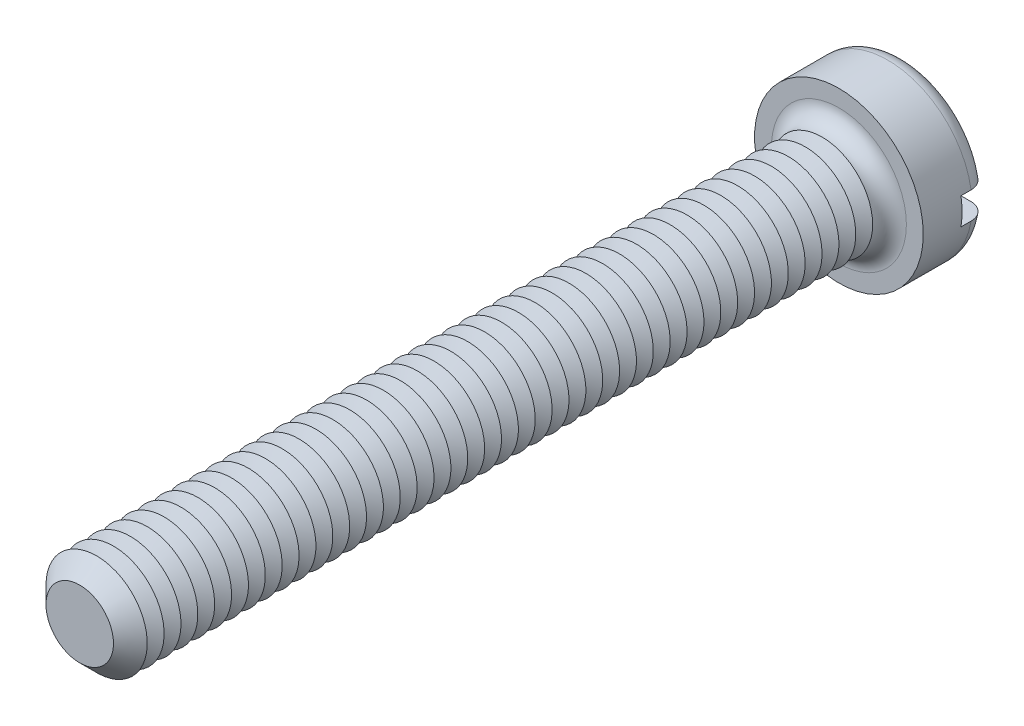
from build123d import *

# Parameters (mm, degrees)
SKETCH3_R           = 5
BOSS_EXTRUDE2_DEPTH = 3.9
SKETCH4_R           = 3
BOSS_EXTRUDE3_DEPTH = 45
FILLET1_R           = 1
CHAMFER1_SIZE       = 1
LPATTERN1_COUNT     = 43
LPATTERN1_PITCH     = 1
SKETCH8_W           = 10
SKETCH8_H           = 1.6
CUT_EXTRUDE1_DEPTH  = 1.6


with BuildPart() as part:
    # Sketch3 → Boss-Extrude2 (new body)
    with BuildSketch(Plane.XY):
        Circle(SKETCH3_R)
    extrude(amount=-BOSS_EXTRUDE2_DEPTH)

    # Sketch4 → Boss-Extrude3 (add)
    with BuildSketch(Plane.XY):
        with Locations(Location((0, 0, 0), (0, 0, 180))):
            Circle(SKETCH4_R)
    extrude(amount=BOSS_EXTRUDE3_DEPTH)

    # Fillet1
    fillet1_edges = [part.edges().sort_by_distance(p)[0] for p in [
        (-5, 0, -3.9),
        (3, 0, 0),
    ]]
    fillet(fillet1_edges, radius=FILLET1_R)

    # Chamfer1
    chamfer1_edges = [part.edges().sort_by_distance(p)[0] for p in [
        (3, 0, 45),
    ]]
    chamfer(chamfer1_edges, length=CHAMFER1_SIZE)

    # Sketch6 → Cut-Revolve1 (revolve, cut)
    with BuildSketch(Plane(origin=(0, 0, 0), x_dir=(0, 0, -1), z_dir=(1, 0, 0)), mode=Mode.PRIVATE) as cut_revolve1_sk:
        Polygon((-1, 3), (-1.5, 2.133974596), (-2, 3), align=None)
    cut_revolve1 = revolve(cut_revolve1_sk.sketch.rotate(Axis((0, 0, -1.694361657), (0, 0, 1)), 90), axis=Axis((0, 0, -1.694361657), (0, 0, 1)), mode=Mode.SUBTRACT)

    # LPattern1: Cut-Revolve1 ×43
    with Locations(*[(0, 0, i * LPATTERN1_PITCH) for i in range(1, LPATTERN1_COUNT)]):
        add(cut_revolve1, mode=Mode.SUBTRACT)

    # Sketch8 → Cut-Extrude1 (cut)
    with BuildSketch(Plane(origin=(0, 0, -3.9), x_dir=(-1, 0, 0), z_dir=(0, 0, -1))):
        Rectangle(SKETCH8_W, SKETCH8_H)
    extrude(amount=-CUT_EXTRUDE1_DEPTH, mode=Mode.SUBTRACT)


solid = part.part
